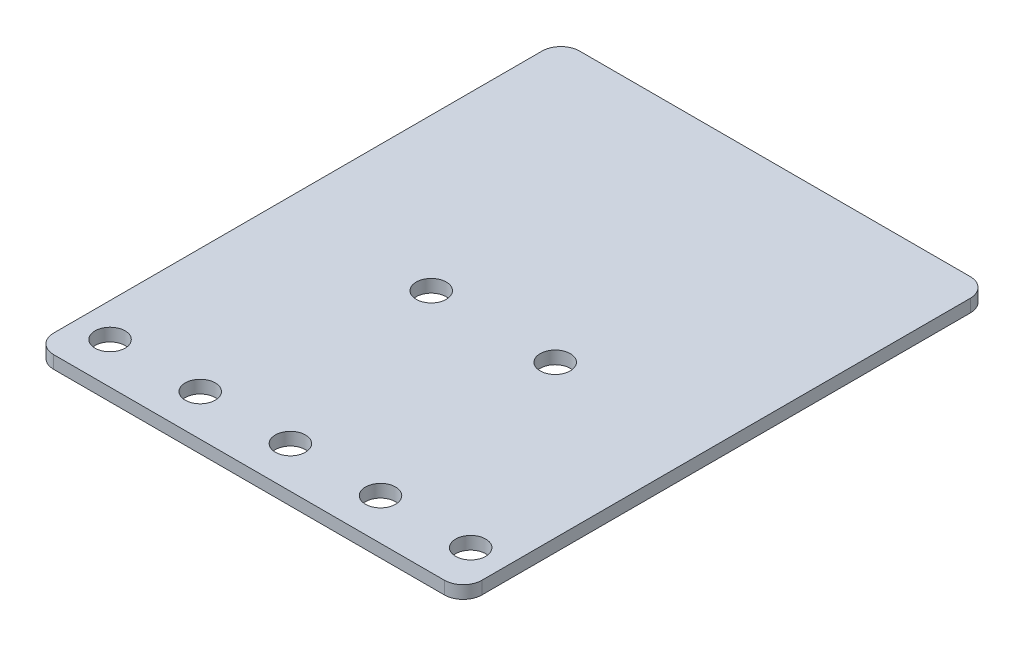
ISO-10303-21;
HEADER;
FILE_DESCRIPTION(('STEP AP214'),'2;1');
FILE_NAME('part.step','',(''),(''),'','','');
FILE_SCHEMA(('AUTOMOTIVE_DESIGN { 1 0 10303 214 1 1 1 1 }'));
ENDSEC;
DATA;
#1=APPLICATION_CONTEXT('core data for automotive mechanical design processes');
#2=APPLICATION_PROTOCOL_DEFINITION('international standard','automotive_design',2000,#1);
#3=PRODUCT_CONTEXT('',#1,'mechanical');
#4=PRODUCT('Part','Part','',(#3));
#5=PRODUCT_RELATED_PRODUCT_CATEGORY('part','',(#4));
#6=PRODUCT_DEFINITION_FORMATION('','',#4);
#7=PRODUCT_DEFINITION_CONTEXT('part definition',#1,'design');
#8=PRODUCT_DEFINITION('design','',#6,#7);
#9=PRODUCT_DEFINITION_SHAPE('','',#8);
#10=(LENGTH_UNIT() NAMED_UNIT(*) SI_UNIT(.MILLI.,.METRE.));
#11=(NAMED_UNIT(*) PLANE_ANGLE_UNIT() SI_UNIT($,.RADIAN.));
#12=(NAMED_UNIT(*) SI_UNIT($,.STERADIAN.) SOLID_ANGLE_UNIT());
#13=UNCERTAINTY_MEASURE_WITH_UNIT(LENGTH_MEASURE(1.E-05),#10,'distance_accuracy_value','');
#14=(GEOMETRIC_REPRESENTATION_CONTEXT(3) GLOBAL_UNCERTAINTY_ASSIGNED_CONTEXT((#13)) GLOBAL_UNIT_ASSIGNED_CONTEXT((#10,
#11,#12)) REPRESENTATION_CONTEXT('',''));
#15=CARTESIAN_POINT('',(0.,0.,0.));
#16=DIRECTION('',(0.,0.,1.));
#17=DIRECTION('',(1.,0.,0.));
#18=AXIS2_PLACEMENT_3D('',#15,#16,#17);
#19=CARTESIAN_POINT('',(-26.,1.7,32.5));
#20=DIRECTION('',(0.,1.,0.));
#21=DIRECTION('',(0.,0.,1.));
#22=AXIS2_PLACEMENT_3D('',#19,#20,#21);
#23=PLANE('',#22);
#24=CARTESIAN_POINT('',(-12.,1.7,29.5));
#25=DIRECTION('',(0.,1.,0.));
#26=DIRECTION('',(0.,0.,1.));
#27=AXIS2_PLACEMENT_3D('',#24,#25,#26);
#28=CIRCLE('',#27,2.);
#29=CARTESIAN_POINT('',(-12.,1.7,31.5));
#30=VERTEX_POINT('',#29);
#31=EDGE_CURVE('E207',#30,#30,#28,.T.);
#32=ORIENTED_EDGE('',*,*,#31,.F.);
#33=EDGE_LOOP('',(#32));
#34=FACE_BOUND('',#33,.T.);
#35=CARTESIAN_POINT('',(12.,1.7,29.5));
#36=DIRECTION('',(0.,1.,0.));
#37=DIRECTION('',(0.,0.,1.));
#38=AXIS2_PLACEMENT_3D('',#35,#36,#37);
#39=CIRCLE('',#38,2.);
#40=CARTESIAN_POINT('',(12.,1.7,31.5));
#41=VERTEX_POINT('',#40);
#42=EDGE_CURVE('E195',#41,#41,#39,.T.);
#43=ORIENTED_EDGE('',*,*,#42,.F.);
#44=EDGE_LOOP('',(#43));
#45=FACE_BOUND('',#44,.T.);
#46=CARTESIAN_POINT('',(-8.24999999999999,1.7,2.5));
#47=DIRECTION('',(0.,1.,0.));
#48=DIRECTION('',(0.,0.,1.));
#49=AXIS2_PLACEMENT_3D('',#46,#47,#48);
#50=CIRCLE('',#49,2.);
#51=CARTESIAN_POINT('',(-8.24999999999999,1.7,4.5));
#52=VERTEX_POINT('',#51);
#53=EDGE_CURVE('E183',#52,#52,#50,.T.);
#54=ORIENTED_EDGE('',*,*,#53,.F.);
#55=EDGE_LOOP('',(#54));
#56=FACE_BOUND('',#55,.T.);
#57=CARTESIAN_POINT('',(-26.,1.7,32.5));
#58=DIRECTION('',(0.,1.,0.));
#59=DIRECTION('',(0.,0.,1.));
#60=AXIS2_PLACEMENT_3D('',#57,#58,#59);
#61=CIRCLE('',#60,2.5);
#62=CARTESIAN_POINT('',(-28.5,1.7,32.5));
#63=VERTEX_POINT('',#62);
#64=CARTESIAN_POINT('',(-26.,1.7,35.));
#65=VERTEX_POINT('',#64);
#66=EDGE_CURVE('E146',#63,#65,#61,.T.);
#67=ORIENTED_EDGE('',*,*,#66,.T.);
#68=DIRECTION('',(1.,0.,0.));
#69=VECTOR('',#68,1.);
#70=CARTESIAN_POINT('',(-26.,1.7,35.));
#71=LINE('',#70,#69);
#72=CARTESIAN_POINT('',(26.,1.7,35.));
#73=VERTEX_POINT('',#72);
#74=EDGE_CURVE('E94',#65,#73,#71,.T.);
#75=ORIENTED_EDGE('',*,*,#74,.T.);
#76=CARTESIAN_POINT('',(26.,1.7,32.5));
#77=DIRECTION('',(0.,1.,0.));
#78=DIRECTION('',(0.,0.,1.));
#79=AXIS2_PLACEMENT_3D('',#76,#77,#78);
#80=CIRCLE('',#79,2.5);
#81=CARTESIAN_POINT('',(28.5,1.7,32.5));
#82=VERTEX_POINT('',#81);
#83=EDGE_CURVE('E161',#73,#82,#80,.T.);
#84=ORIENTED_EDGE('',*,*,#83,.T.);
#85=DIRECTION('',(0.,0.,-1.));
#86=VECTOR('',#85,1.);
#87=CARTESIAN_POINT('',(28.5,1.7,-32.5));
#88=LINE('',#87,#86);
#89=CARTESIAN_POINT('',(28.5,1.7,-32.5));
#90=VERTEX_POINT('',#89);
#91=EDGE_CURVE('E174',#82,#90,#88,.T.);
#92=ORIENTED_EDGE('',*,*,#91,.T.);
#93=CARTESIAN_POINT('',(26.,1.7,-32.5));
#94=DIRECTION('',(0.,1.,0.));
#95=DIRECTION('',(0.,0.,-1.));
#96=AXIS2_PLACEMENT_3D('',#93,#94,#95);
#97=CIRCLE('',#96,2.5);
#98=CARTESIAN_POINT('',(26.,1.7,-35.));
#99=VERTEX_POINT('',#98);
#100=EDGE_CURVE('E113',#90,#99,#97,.T.);
#101=ORIENTED_EDGE('',*,*,#100,.T.);
#102=DIRECTION('',(-1.,0.,0.));
#103=VECTOR('',#102,1.);
#104=CARTESIAN_POINT('',(-26.,1.7,-35.));
#105=LINE('',#104,#103);
#106=CARTESIAN_POINT('',(-26.,1.7,-35.));
#107=VERTEX_POINT('',#106);
#108=EDGE_CURVE('E107',#99,#107,#105,.T.);
#109=ORIENTED_EDGE('',*,*,#108,.T.);
#110=CARTESIAN_POINT('',(-26.,1.7,-32.5));
#111=DIRECTION('',(0.,1.,0.));
#112=DIRECTION('',(0.,0.,1.));
#113=AXIS2_PLACEMENT_3D('',#110,#111,#112);
#114=CIRCLE('',#113,2.5);
#115=CARTESIAN_POINT('',(-28.5,1.7,-32.5));
#116=VERTEX_POINT('',#115);
#117=EDGE_CURVE('E111',#107,#116,#114,.T.);
#118=ORIENTED_EDGE('',*,*,#117,.T.);
#119=DIRECTION('',(0.,0.,1.));
#120=VECTOR('',#119,1.);
#121=CARTESIAN_POINT('',(-28.5,1.7,-32.5));
#122=LINE('',#121,#120);
#123=EDGE_CURVE('E51',#116,#63,#122,.T.);
#124=ORIENTED_EDGE('',*,*,#123,.T.);
#125=EDGE_LOOP('',(#67,#75,#84,#92,#101,#109,#118,#124));
#126=FACE_BOUND('',#125,.T.);
#127=CARTESIAN_POINT('',(8.25000000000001,1.7,2.5));
#128=DIRECTION('',(0.,1.,0.));
#129=DIRECTION('',(0.,0.,1.));
#130=AXIS2_PLACEMENT_3D('',#127,#128,#129);
#131=CIRCLE('',#130,2.);
#132=CARTESIAN_POINT('',(8.25000000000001,1.7,4.5));
#133=VERTEX_POINT('',#132);
#134=EDGE_CURVE('E135',#133,#133,#131,.T.);
#135=ORIENTED_EDGE('',*,*,#134,.F.);
#136=EDGE_LOOP('',(#135));
#137=FACE_BOUND('',#136,.T.);
#138=CARTESIAN_POINT('',(0.,1.7,29.5));
#139=DIRECTION('',(0.,1.,0.));
#140=DIRECTION('',(0.,0.,1.));
#141=AXIS2_PLACEMENT_3D('',#138,#139,#140);
#142=CIRCLE('',#141,2.);
#143=CARTESIAN_POINT('',(0.,1.7,31.5));
#144=VERTEX_POINT('',#143);
#145=EDGE_CURVE('E189',#144,#144,#142,.T.);
#146=ORIENTED_EDGE('',*,*,#145,.F.);
#147=EDGE_LOOP('',(#146));
#148=FACE_BOUND('',#147,.T.);
#149=CARTESIAN_POINT('',(24.,1.7,29.5));
#150=DIRECTION('',(0.,1.,0.));
#151=DIRECTION('',(0.,0.,1.));
#152=AXIS2_PLACEMENT_3D('',#149,#150,#151);
#153=CIRCLE('',#152,2.);
#154=CARTESIAN_POINT('',(24.,1.7,31.5));
#155=VERTEX_POINT('',#154);
#156=EDGE_CURVE('E201',#155,#155,#153,.T.);
#157=ORIENTED_EDGE('',*,*,#156,.F.);
#158=EDGE_LOOP('',(#157));
#159=FACE_BOUND('',#158,.T.);
#160=CARTESIAN_POINT('',(-24.,1.7,29.5));
#161=DIRECTION('',(0.,1.,0.));
#162=DIRECTION('',(0.,0.,1.));
#163=AXIS2_PLACEMENT_3D('',#160,#161,#162);
#164=CIRCLE('',#163,2.);
#165=CARTESIAN_POINT('',(-24.,1.7,31.5));
#166=VERTEX_POINT('',#165);
#167=EDGE_CURVE('E213',#166,#166,#164,.T.);
#168=ORIENTED_EDGE('',*,*,#167,.F.);
#169=EDGE_LOOP('',(#168));
#170=FACE_BOUND('',#169,.T.);
#171=ADVANCED_FACE('F34',(#34,#45,#56,#126,#137,#148,#159,#170),#23,.T.);
#172=CARTESIAN_POINT('',(-26.,0.,32.5));
#173=DIRECTION('',(0.,1.,0.));
#174=DIRECTION('',(0.,0.,1.));
#175=AXIS2_PLACEMENT_3D('',#172,#173,#174);
#176=PLANE('',#175);
#177=CARTESIAN_POINT('',(-26.,0.,32.5));
#178=DIRECTION('',(0.,1.,0.));
#179=DIRECTION('',(0.,0.,1.));
#180=AXIS2_PLACEMENT_3D('',#177,#178,#179);
#181=CIRCLE('',#180,2.5);
#182=CARTESIAN_POINT('',(-28.5,0.,32.5));
#183=VERTEX_POINT('',#182);
#184=CARTESIAN_POINT('',(-26.,0.,35.));
#185=VERTEX_POINT('',#184);
#186=EDGE_CURVE('E131',#183,#185,#181,.T.);
#187=ORIENTED_EDGE('',*,*,#186,.F.);
#188=DIRECTION('',(0.,0.,1.));
#189=VECTOR('',#188,1.);
#190=CARTESIAN_POINT('',(-28.5,0.,-32.5));
#191=LINE('',#190,#189);
#192=CARTESIAN_POINT('',(-28.5,0.,-32.5));
#193=VERTEX_POINT('',#192);
#194=EDGE_CURVE('E86',#193,#183,#191,.T.);
#195=ORIENTED_EDGE('',*,*,#194,.F.);
#196=CARTESIAN_POINT('',(-26.,0.,-32.5));
#197=DIRECTION('',(0.,1.,0.));
#198=DIRECTION('',(0.,0.,1.));
#199=AXIS2_PLACEMENT_3D('',#196,#197,#198);
#200=CIRCLE('',#199,2.5);
#201=CARTESIAN_POINT('',(-26.,0.,-35.));
#202=VERTEX_POINT('',#201);
#203=EDGE_CURVE('E80',#202,#193,#200,.T.);
#204=ORIENTED_EDGE('',*,*,#203,.F.);
#205=DIRECTION('',(-1.,0.,0.));
#206=VECTOR('',#205,1.);
#207=CARTESIAN_POINT('',(-26.,0.,-35.));
#208=LINE('',#207,#206);
#209=CARTESIAN_POINT('',(26.,0.,-35.));
#210=VERTEX_POINT('',#209);
#211=EDGE_CURVE('E121',#210,#202,#208,.T.);
#212=ORIENTED_EDGE('',*,*,#211,.F.);
#213=CARTESIAN_POINT('',(26.,0.,-32.5));
#214=DIRECTION('',(0.,1.,0.));
#215=DIRECTION('',(0.,0.,-1.));
#216=AXIS2_PLACEMENT_3D('',#213,#214,#215);
#217=CIRCLE('',#216,2.5);
#218=CARTESIAN_POINT('',(28.5,0.,-32.5));
#219=VERTEX_POINT('',#218);
#220=EDGE_CURVE('E141',#219,#210,#217,.T.);
#221=ORIENTED_EDGE('',*,*,#220,.F.);
#222=DIRECTION('',(0.,0.,-1.));
#223=VECTOR('',#222,1.);
#224=CARTESIAN_POINT('',(28.5,0.,-32.5));
#225=LINE('',#224,#223);
#226=CARTESIAN_POINT('',(28.5,0.,32.5));
#227=VERTEX_POINT('',#226);
#228=EDGE_CURVE('E139',#227,#219,#225,.T.);
#229=ORIENTED_EDGE('',*,*,#228,.F.);
#230=CARTESIAN_POINT('',(26.,0.,32.5));
#231=DIRECTION('',(0.,1.,0.));
#232=DIRECTION('',(0.,0.,1.));
#233=AXIS2_PLACEMENT_3D('',#230,#231,#232);
#234=CIRCLE('',#233,2.5);
#235=CARTESIAN_POINT('',(26.,0.,35.));
#236=VERTEX_POINT('',#235);
#237=EDGE_CURVE('E137',#236,#227,#234,.T.);
#238=ORIENTED_EDGE('',*,*,#237,.F.);
#239=DIRECTION('',(1.,0.,0.));
#240=VECTOR('',#239,1.);
#241=CARTESIAN_POINT('',(-26.,0.,35.));
#242=LINE('',#241,#240);
#243=EDGE_CURVE('E134',#185,#236,#242,.T.);
#244=ORIENTED_EDGE('',*,*,#243,.F.);
#245=EDGE_LOOP('',(#187,#195,#204,#212,#221,#229,#238,#244));
#246=FACE_BOUND('',#245,.T.);
#247=CARTESIAN_POINT('',(8.25000000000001,0.,2.5));
#248=DIRECTION('',(0.,1.,0.));
#249=DIRECTION('',(0.,0.,1.));
#250=AXIS2_PLACEMENT_3D('',#247,#248,#249);
#251=CIRCLE('',#250,2.);
#252=CARTESIAN_POINT('',(8.25000000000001,0.,4.5));
#253=VERTEX_POINT('',#252);
#254=EDGE_CURVE('E180',#253,#253,#251,.T.);
#255=ORIENTED_EDGE('',*,*,#254,.T.);
#256=EDGE_LOOP('',(#255));
#257=FACE_BOUND('',#256,.T.);
#258=CARTESIAN_POINT('',(-8.24999999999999,0.,2.5));
#259=DIRECTION('',(0.,1.,0.));
#260=DIRECTION('',(0.,0.,1.));
#261=AXIS2_PLACEMENT_3D('',#258,#259,#260);
#262=CIRCLE('',#261,2.);
#263=CARTESIAN_POINT('',(-8.24999999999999,0.,4.5));
#264=VERTEX_POINT('',#263);
#265=EDGE_CURVE('E186',#264,#264,#262,.T.);
#266=ORIENTED_EDGE('',*,*,#265,.T.);
#267=EDGE_LOOP('',(#266));
#268=FACE_BOUND('',#267,.T.);
#269=CARTESIAN_POINT('',(0.,0.,29.5));
#270=DIRECTION('',(0.,1.,0.));
#271=DIRECTION('',(0.,0.,1.));
#272=AXIS2_PLACEMENT_3D('',#269,#270,#271);
#273=CIRCLE('',#272,2.);
#274=CARTESIAN_POINT('',(0.,0.,31.5));
#275=VERTEX_POINT('',#274);
#276=EDGE_CURVE('E192',#275,#275,#273,.T.);
#277=ORIENTED_EDGE('',*,*,#276,.T.);
#278=EDGE_LOOP('',(#277));
#279=FACE_BOUND('',#278,.T.);
#280=CARTESIAN_POINT('',(12.,0.,29.5));
#281=DIRECTION('',(0.,1.,0.));
#282=DIRECTION('',(0.,0.,1.));
#283=AXIS2_PLACEMENT_3D('',#280,#281,#282);
#284=CIRCLE('',#283,2.);
#285=CARTESIAN_POINT('',(12.,0.,31.5));
#286=VERTEX_POINT('',#285);
#287=EDGE_CURVE('E198',#286,#286,#284,.T.);
#288=ORIENTED_EDGE('',*,*,#287,.T.);
#289=EDGE_LOOP('',(#288));
#290=FACE_BOUND('',#289,.T.);
#291=CARTESIAN_POINT('',(24.,0.,29.5));
#292=DIRECTION('',(0.,1.,0.));
#293=DIRECTION('',(0.,0.,1.));
#294=AXIS2_PLACEMENT_3D('',#291,#292,#293);
#295=CIRCLE('',#294,2.);
#296=CARTESIAN_POINT('',(24.,0.,31.5));
#297=VERTEX_POINT('',#296);
#298=EDGE_CURVE('E204',#297,#297,#295,.T.);
#299=ORIENTED_EDGE('',*,*,#298,.T.);
#300=EDGE_LOOP('',(#299));
#301=FACE_BOUND('',#300,.T.);
#302=CARTESIAN_POINT('',(-12.,0.,29.5));
#303=DIRECTION('',(0.,1.,0.));
#304=DIRECTION('',(0.,0.,1.));
#305=AXIS2_PLACEMENT_3D('',#302,#303,#304);
#306=CIRCLE('',#305,2.);
#307=CARTESIAN_POINT('',(-12.,0.,31.5));
#308=VERTEX_POINT('',#307);
#309=EDGE_CURVE('E210',#308,#308,#306,.T.);
#310=ORIENTED_EDGE('',*,*,#309,.T.);
#311=EDGE_LOOP('',(#310));
#312=FACE_BOUND('',#311,.T.);
#313=CARTESIAN_POINT('',(-24.,0.,29.5));
#314=DIRECTION('',(0.,1.,0.));
#315=DIRECTION('',(0.,0.,1.));
#316=AXIS2_PLACEMENT_3D('',#313,#314,#315);
#317=CIRCLE('',#316,2.);
#318=CARTESIAN_POINT('',(-24.,0.,31.5));
#319=VERTEX_POINT('',#318);
#320=EDGE_CURVE('E216',#319,#319,#317,.T.);
#321=ORIENTED_EDGE('',*,*,#320,.T.);
#322=EDGE_LOOP('',(#321));
#323=FACE_BOUND('',#322,.T.);
#324=ADVANCED_FACE('F165',(#246,#257,#268,#279,#290,#301,#312,#323),#176,.F.);
#325=CARTESIAN_POINT('',(-26.,1.7,32.5));
#326=DIRECTION('',(0.,-1.,0.));
#327=DIRECTION('',(0.,0.,-1.));
#328=AXIS2_PLACEMENT_3D('',#325,#326,#327);
#329=CYLINDRICAL_SURFACE('',#328,2.5);
#330=ORIENTED_EDGE('',*,*,#186,.T.);
#331=DIRECTION('',(0.,-1.,0.));
#332=VECTOR('',#331,1.);
#333=CARTESIAN_POINT('',(-26.,1.7,35.));
#334=LINE('',#333,#332);
#335=EDGE_CURVE('E11',#65,#185,#334,.T.);
#336=ORIENTED_EDGE('',*,*,#335,.F.);
#337=ORIENTED_EDGE('',*,*,#66,.F.);
#338=DIRECTION('',(0.,-1.,0.));
#339=VECTOR('',#338,1.);
#340=CARTESIAN_POINT('',(-28.5,1.7,32.5));
#341=LINE('',#340,#339);
#342=EDGE_CURVE('E127',#63,#183,#341,.T.);
#343=ORIENTED_EDGE('',*,*,#342,.T.);
#344=EDGE_LOOP('',(#330,#336,#337,#343));
#345=FACE_BOUND('',#344,.T.);
#346=ADVANCED_FACE('F36',(#345),#329,.T.);
#347=CARTESIAN_POINT('',(-26.,1.7,35.));
#348=DIRECTION('',(0.,0.,-1.));
#349=DIRECTION('',(-1.,0.,0.));
#350=AXIS2_PLACEMENT_3D('',#347,#348,#349);
#351=PLANE('',#350);
#352=ORIENTED_EDGE('',*,*,#243,.T.);
#353=DIRECTION('',(0.,-1.,0.));
#354=VECTOR('',#353,1.);
#355=CARTESIAN_POINT('',(26.,1.7,35.));
#356=LINE('',#355,#354);
#357=EDGE_CURVE('E43',#73,#236,#356,.T.);
#358=ORIENTED_EDGE('',*,*,#357,.F.);
#359=ORIENTED_EDGE('',*,*,#74,.F.);
#360=ORIENTED_EDGE('',*,*,#335,.T.);
#361=EDGE_LOOP('',(#352,#358,#359,#360));
#362=FACE_BOUND('',#361,.T.);
#363=ADVANCED_FACE('F250',(#362),#351,.F.);
#364=CARTESIAN_POINT('',(26.,1.7,32.5));
#365=DIRECTION('',(0.,-1.,0.));
#366=DIRECTION('',(0.,0.,-1.));
#367=AXIS2_PLACEMENT_3D('',#364,#365,#366);
#368=CYLINDRICAL_SURFACE('',#367,2.5);
#369=ORIENTED_EDGE('',*,*,#237,.T.);
#370=DIRECTION('',(0.,-1.,0.));
#371=VECTOR('',#370,1.);
#372=CARTESIAN_POINT('',(28.5,1.7,32.5));
#373=LINE('',#372,#371);
#374=EDGE_CURVE('E153',#82,#227,#373,.T.);
#375=ORIENTED_EDGE('',*,*,#374,.F.);
#376=ORIENTED_EDGE('',*,*,#83,.F.);
#377=ORIENTED_EDGE('',*,*,#357,.T.);
#378=EDGE_LOOP('',(#369,#375,#376,#377));
#379=FACE_BOUND('',#378,.T.);
#380=ADVANCED_FACE('F159',(#379),#368,.T.);
#381=CARTESIAN_POINT('',(28.5,1.7,-32.5));
#382=DIRECTION('',(-1.,0.,0.));
#383=DIRECTION('',(0.,0.,1.));
#384=AXIS2_PLACEMENT_3D('',#381,#382,#383);
#385=PLANE('',#384);
#386=ORIENTED_EDGE('',*,*,#228,.T.);
#387=DIRECTION('',(0.,-1.,0.));
#388=VECTOR('',#387,1.);
#389=CARTESIAN_POINT('',(28.5,1.7,-32.5));
#390=LINE('',#389,#388);
#391=EDGE_CURVE('E150',#90,#219,#390,.T.);
#392=ORIENTED_EDGE('',*,*,#391,.F.);
#393=ORIENTED_EDGE('',*,*,#91,.F.);
#394=ORIENTED_EDGE('',*,*,#374,.T.);
#395=EDGE_LOOP('',(#386,#392,#393,#394));
#396=FACE_BOUND('',#395,.T.);
#397=ADVANCED_FACE('F170',(#396),#385,.F.);
#398=CARTESIAN_POINT('',(26.,1.7,-32.5));
#399=DIRECTION('',(0.,-1.,0.));
#400=DIRECTION('',(0.,0.,-1.));
#401=AXIS2_PLACEMENT_3D('',#398,#399,#400);
#402=CYLINDRICAL_SURFACE('',#401,2.5);
#403=ORIENTED_EDGE('',*,*,#220,.T.);
#404=DIRECTION('',(0.,-1.,0.));
#405=VECTOR('',#404,1.);
#406=CARTESIAN_POINT('',(26.,1.7,-35.));
#407=LINE('',#406,#405);
#408=EDGE_CURVE('E122',#99,#210,#407,.T.);
#409=ORIENTED_EDGE('',*,*,#408,.F.);
#410=ORIENTED_EDGE('',*,*,#100,.F.);
#411=ORIENTED_EDGE('',*,*,#391,.T.);
#412=EDGE_LOOP('',(#403,#409,#410,#411));
#413=FACE_BOUND('',#412,.T.);
#414=ADVANCED_FACE('F173',(#413),#402,.T.);
#415=CARTESIAN_POINT('',(-26.,1.7,-35.));
#416=DIRECTION('',(0.,0.,1.));
#417=DIRECTION('',(1.,0.,0.));
#418=AXIS2_PLACEMENT_3D('',#415,#416,#417);
#419=PLANE('',#418);
#420=ORIENTED_EDGE('',*,*,#211,.T.);
#421=DIRECTION('',(0.,-1.,0.));
#422=VECTOR('',#421,1.);
#423=CARTESIAN_POINT('',(-26.,1.7,-35.));
#424=LINE('',#423,#422);
#425=EDGE_CURVE('E118',#107,#202,#424,.T.);
#426=ORIENTED_EDGE('',*,*,#425,.F.);
#427=ORIENTED_EDGE('',*,*,#108,.F.);
#428=ORIENTED_EDGE('',*,*,#408,.T.);
#429=EDGE_LOOP('',(#420,#426,#427,#428));
#430=FACE_BOUND('',#429,.T.);
#431=ADVANCED_FACE('F119',(#430),#419,.F.);
#432=CARTESIAN_POINT('',(-26.,1.7,-32.5));
#433=DIRECTION('',(0.,-1.,0.));
#434=DIRECTION('',(0.,0.,-1.));
#435=AXIS2_PLACEMENT_3D('',#432,#433,#434);
#436=CYLINDRICAL_SURFACE('',#435,2.5);
#437=ORIENTED_EDGE('',*,*,#203,.T.);
#438=DIRECTION('',(0.,-1.,0.));
#439=VECTOR('',#438,1.);
#440=CARTESIAN_POINT('',(-28.5,1.7,-32.5));
#441=LINE('',#440,#439);
#442=EDGE_CURVE('E123',#116,#193,#441,.T.);
#443=ORIENTED_EDGE('',*,*,#442,.F.);
#444=ORIENTED_EDGE('',*,*,#117,.F.);
#445=ORIENTED_EDGE('',*,*,#425,.T.);
#446=EDGE_LOOP('',(#437,#443,#444,#445));
#447=FACE_BOUND('',#446,.T.);
#448=ADVANCED_FACE('F125',(#447),#436,.T.);
#449=CARTESIAN_POINT('',(-28.5,1.7,-32.5));
#450=DIRECTION('',(1.,0.,0.));
#451=DIRECTION('',(0.,0.,-1.));
#452=AXIS2_PLACEMENT_3D('',#449,#450,#451);
#453=PLANE('',#452);
#454=ORIENTED_EDGE('',*,*,#194,.T.);
#455=ORIENTED_EDGE('',*,*,#342,.F.);
#456=ORIENTED_EDGE('',*,*,#123,.F.);
#457=ORIENTED_EDGE('',*,*,#442,.T.);
#458=EDGE_LOOP('',(#454,#455,#456,#457));
#459=FACE_BOUND('',#458,.T.);
#460=ADVANCED_FACE('F238',(#459),#453,.F.);
#461=CARTESIAN_POINT('',(8.25000000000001,1.7,2.5));
#462=DIRECTION('',(0.,-1.,0.));
#463=DIRECTION('',(0.,0.,-1.));
#464=AXIS2_PLACEMENT_3D('',#461,#462,#463);
#465=CYLINDRICAL_SURFACE('',#464,2.);
#466=ORIENTED_EDGE('',*,*,#134,.T.);
#467=EDGE_LOOP('',(#466));
#468=FACE_BOUND('',#467,.T.);
#469=ORIENTED_EDGE('',*,*,#254,.F.);
#470=EDGE_LOOP('',(#469));
#471=FACE_BOUND('',#470,.T.);
#472=ADVANCED_FACE('F235',(#468,#471),#465,.F.);
#473=CARTESIAN_POINT('',(-8.24999999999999,1.7,2.5));
#474=DIRECTION('',(0.,-1.,0.));
#475=DIRECTION('',(0.,0.,-1.));
#476=AXIS2_PLACEMENT_3D('',#473,#474,#475);
#477=CYLINDRICAL_SURFACE('',#476,2.);
#478=ORIENTED_EDGE('',*,*,#53,.T.);
#479=EDGE_LOOP('',(#478));
#480=FACE_BOUND('',#479,.T.);
#481=ORIENTED_EDGE('',*,*,#265,.F.);
#482=EDGE_LOOP('',(#481));
#483=FACE_BOUND('',#482,.T.);
#484=ADVANCED_FACE('F318',(#480,#483),#477,.F.);
#485=CARTESIAN_POINT('',(0.,1.7,29.5));
#486=DIRECTION('',(0.,-1.,0.));
#487=DIRECTION('',(0.,0.,-1.));
#488=AXIS2_PLACEMENT_3D('',#485,#486,#487);
#489=CYLINDRICAL_SURFACE('',#488,2.);
#490=ORIENTED_EDGE('',*,*,#145,.T.);
#491=EDGE_LOOP('',(#490));
#492=FACE_BOUND('',#491,.T.);
#493=ORIENTED_EDGE('',*,*,#276,.F.);
#494=EDGE_LOOP('',(#493));
#495=FACE_BOUND('',#494,.T.);
#496=ADVANCED_FACE('F326',(#492,#495),#489,.F.);
#497=CARTESIAN_POINT('',(12.,1.7,29.5));
#498=DIRECTION('',(0.,-1.,0.));
#499=DIRECTION('',(0.,0.,-1.));
#500=AXIS2_PLACEMENT_3D('',#497,#498,#499);
#501=CYLINDRICAL_SURFACE('',#500,2.);
#502=ORIENTED_EDGE('',*,*,#42,.T.);
#503=EDGE_LOOP('',(#502));
#504=FACE_BOUND('',#503,.T.);
#505=ORIENTED_EDGE('',*,*,#287,.F.);
#506=EDGE_LOOP('',(#505));
#507=FACE_BOUND('',#506,.T.);
#508=ADVANCED_FACE('F334',(#504,#507),#501,.F.);
#509=CARTESIAN_POINT('',(24.,1.7,29.5));
#510=DIRECTION('',(0.,-1.,0.));
#511=DIRECTION('',(0.,0.,-1.));
#512=AXIS2_PLACEMENT_3D('',#509,#510,#511);
#513=CYLINDRICAL_SURFACE('',#512,2.);
#514=ORIENTED_EDGE('',*,*,#156,.T.);
#515=EDGE_LOOP('',(#514));
#516=FACE_BOUND('',#515,.T.);
#517=ORIENTED_EDGE('',*,*,#298,.F.);
#518=EDGE_LOOP('',(#517));
#519=FACE_BOUND('',#518,.T.);
#520=ADVANCED_FACE('F343',(#516,#519),#513,.F.);
#521=CARTESIAN_POINT('',(-12.,1.7,29.5));
#522=DIRECTION('',(0.,-1.,0.));
#523=DIRECTION('',(0.,0.,-1.));
#524=AXIS2_PLACEMENT_3D('',#521,#522,#523);
#525=CYLINDRICAL_SURFACE('',#524,2.);
#526=ORIENTED_EDGE('',*,*,#31,.T.);
#527=EDGE_LOOP('',(#526));
#528=FACE_BOUND('',#527,.T.);
#529=ORIENTED_EDGE('',*,*,#309,.F.);
#530=EDGE_LOOP('',(#529));
#531=FACE_BOUND('',#530,.T.);
#532=ADVANCED_FACE('F352',(#528,#531),#525,.F.);
#533=CARTESIAN_POINT('',(-24.,1.7,29.5));
#534=DIRECTION('',(0.,-1.,0.));
#535=DIRECTION('',(0.,0.,-1.));
#536=AXIS2_PLACEMENT_3D('',#533,#534,#535);
#537=CYLINDRICAL_SURFACE('',#536,2.);
#538=ORIENTED_EDGE('',*,*,#167,.T.);
#539=EDGE_LOOP('',(#538));
#540=FACE_BOUND('',#539,.T.);
#541=ORIENTED_EDGE('',*,*,#320,.F.);
#542=EDGE_LOOP('',(#541));
#543=FACE_BOUND('',#542,.T.);
#544=ADVANCED_FACE('F222',(#540,#543),#537,.F.);
#545=CLOSED_SHELL('',(#171,#324,#346,#363,#380,#397,#414,#431,#448,#460,#472,#484,#496,#508,
#520,#532,#544));
#546=MANIFOLD_SOLID_BREP('B2',#545);
#547=ADVANCED_BREP_SHAPE_REPRESENTATION('',(#18,#546),#14);
#548=SHAPE_DEFINITION_REPRESENTATION(#9,#547);
ENDSEC;
END-ISO-10303-21;
